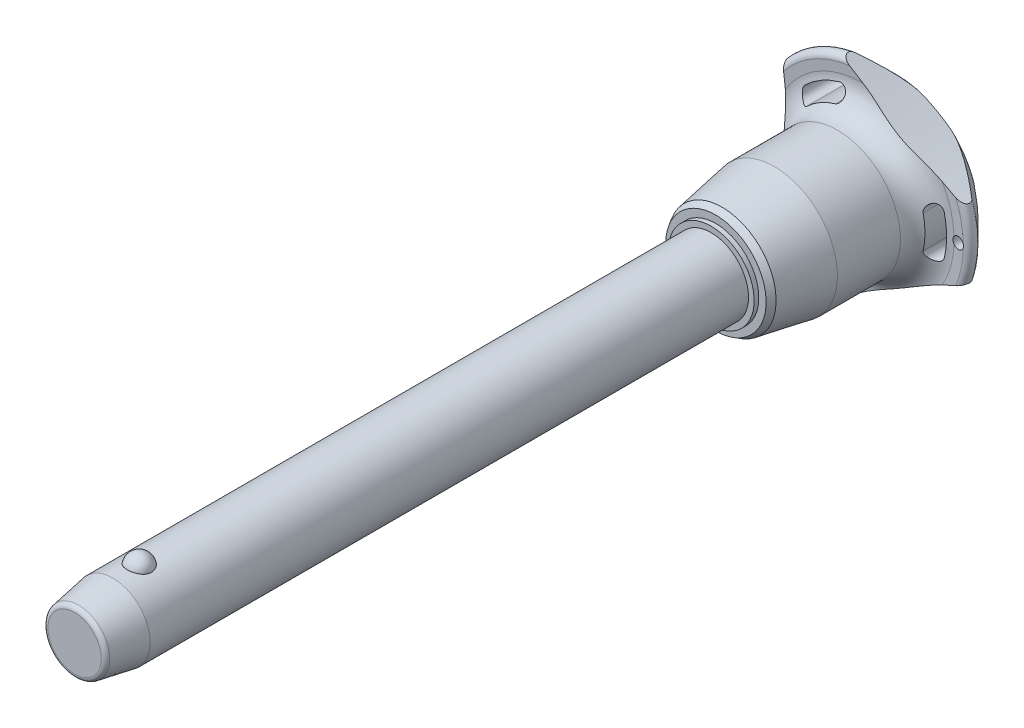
from build123d import *

# Parameters (mm, degrees)
SKETCH1_R           = 10
BOSS_EXTRUDE1_DEPTH = 150
SKETCH2_R           = 8.75
BOSS_EXTRUDE2_DEPTH = 50.7
BOSS_EXTRUDE3_START = 20.5
SKETCH1_2_R         = 10
BOSS_EXTRUDE3_DEPTH = 20.5
CHAMFER1_SIZE       = 10.25
CHAMFER1_SIZE2      = 1.807351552
FILLET1_R           = 1.25
SKETCH6_R           = 176.92625
CUT_EXTRUDE1_DEPTH  = 205.721493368
CIRPATTERN1_COUNT   = 3
SKETCH7_R           = 1.5
CUT_EXTRUDE2_DEPTH  = 205.647121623


with BuildPart() as part:
    # Sketch1 → Boss-Extrude1 (new body)
    with BuildSketch(Plane.XY):
        Circle(SKETCH1_R)
    extrude(amount=-BOSS_EXTRUDE1_DEPTH)

    # Sketch2 → Boss-Extrude2 (add)
    with BuildSketch(Plane(origin=(0, 0, -150), x_dir=(-1, 0, 0), z_dir=(0, 0, -1))):
        with Locations(Location((0, 0, 0), (0, 0, 180))):
            Circle(SKETCH2_R)
    extrude(amount=BOSS_EXTRUDE2_DEPTH)

    # Sketch3 → Revolve1 (revolve)
    with BuildSketch(Plane(origin=(0, 0, 0), x_dir=(0, 0, -1), z_dir=(1, 0, 0))):
        with BuildLine():
            Line((-3.201562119, 12.5), (-3.201562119, 5.9))
            ThreePointArc((-3.201562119, 5.9), (0.098437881, 9.2), (-3.201562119, 12.5))
        make_face()
        with BuildLine():
            Line((-3.201562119, -5.9), (-3.201562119, -12.5))
            ThreePointArc((-3.201562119, -12.5), (0.098437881, -9.2), (-3.201562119, -5.9))
        make_face()
    revolve(axis=Axis((0, -5.9, 3.201562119), (0, 1, 0)))

    # Sketch1_2 → Boss-Extrude3 (add)
    with BuildSketch(Plane.XY.offset(BOSS_EXTRUDE3_START)):
        Circle(SKETCH1_2_R)
    extrude(amount=-BOSS_EXTRUDE3_DEPTH)

    # Chamfer1
    chamfer1_edges = [part.edges().sort_by_distance(p)[0] for p in [
        (-10, 0, 20.5),
    ]]
    chamfer1_side = [part.faces().sort_by_distance(p)[0] for p in [
        (-10, 0, -64.75),
    ]]
    chamfer(chamfer1_edges, length=CHAMFER1_SIZE, length2=CHAMFER1_SIZE2, reference=chamfer1_side[0])

    # Fillet1
    fillet1_edges = [part.edges().sort_by_distance(p)[0] for p in [
        (-8.192648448, 0, 20.5),
        (-8.75, 0, -200.7),
    ]]
    fillet(fillet1_edges, radius=FILLET1_R)

    # Sketch4 → Revolve2 (revolve)
    with BuildSketch(Plane(origin=(0, 0, 0), x_dir=(0, 0, -1), z_dir=(1, 0, 0)), mode=Mode.PRIVATE) as revolve2_sk:
        Polygon((150, 0), (150, 11.504815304), (151.25, 11.504815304), (151.25, 13.461079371), (152.944174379, 14.439211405), (166.9, 16.9), (183.8, 16.9), (183.8, 0), align=None)
    revolve(revolve2_sk.sketch.rotate(Axis((0, 0, -183.8), (0, 0, 1)), 90), axis=Axis((0, 0, -183.8), (0, 0, 1)))

    # Sketch5 → Revolve3 (revolve)
    with BuildSketch(Plane(origin=(0, 0, 0), x_dir=(0, 0, -1), z_dir=(1, 0, 0)), mode=Mode.PRIVATE) as revolve3_sk:
        with BuildLine():
            Line((190.790129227, 24.271609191), (190.652256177, 26.865060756))
            ThreePointArc((190.652256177, 26.865060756), (191.598671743, 28.411427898), (193.38137085, 28.08137085))
            Line((193.38137085, 28.08137085), (199.763226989, 21.69951471))
            ThreePointArc((199.763226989, 21.69951471), (200.7, 19.381044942), (199.683055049, 17.096604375))
            ThreePointArc((199.683055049, 17.096604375), (194.18864484, 9.321268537), (192.25, 0))
            Line((192.25, 0), (183.8, 0))
            Line((183.8, 0), (183.8, 16.9))
            ThreePointArc((183.8, 16.9), (188.879432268, 19.083427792), (190.790129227, 24.271609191))
        make_face()
    revolve(revolve3_sk.sketch.rotate(Axis((0, 0, -192.25), (0, 0, 1)), 90), axis=Axis((0, 0, -192.25), (0, 0, 1)))

    # Sketch6 → Cut-Extrude1 (cut, through all)
    with BuildSketch(Plane.XY):
        with Locations((-197.42625, 0)):
            Circle(SKETCH6_R)
        with BuildLine():
            ThreePointArc((21.802992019, -5.260839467), (22.428706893, 0), (21.802992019, 5.260839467))
            ThreePointArc((21.802992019, 5.260839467), (19.579234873, 6.620060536), (18.220013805, 4.39630339))
            ThreePointArc((18.220013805, 4.39630339), (18.742902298, 0), (18.220013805, -4.39630339))
            ThreePointArc((18.220013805, -4.39630339), (19.579234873, -6.620060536), (21.802992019, -5.260839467))
        make_face()
    cut_extrude1 = extrude(amount=-CUT_EXTRUDE1_DEPTH, mode=Mode.SUBTRACT)

    # CirPattern1: Cut-Extrude1 ×3 about axis
    cirpattern1_axis = Axis((0, 0, 0), (0, 0, 1))
    for i in range(1, CIRPATTERN1_COUNT):
        add(cut_extrude1.rotate(cirpattern1_axis, i * 360 / CIRPATTERN1_COUNT), mode=Mode.SUBTRACT)

    # Sketch7 → Cut-Extrude2 (cut, through all)
    with BuildSketch(Plane.XY):
        with Locations(Location((25.428706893, 0, 0), (0, 0, 17.230769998))):
            Circle(SKETCH7_R)
    extrude(amount=-CUT_EXTRUDE2_DEPTH, mode=Mode.SUBTRACT)


solid = part.part
